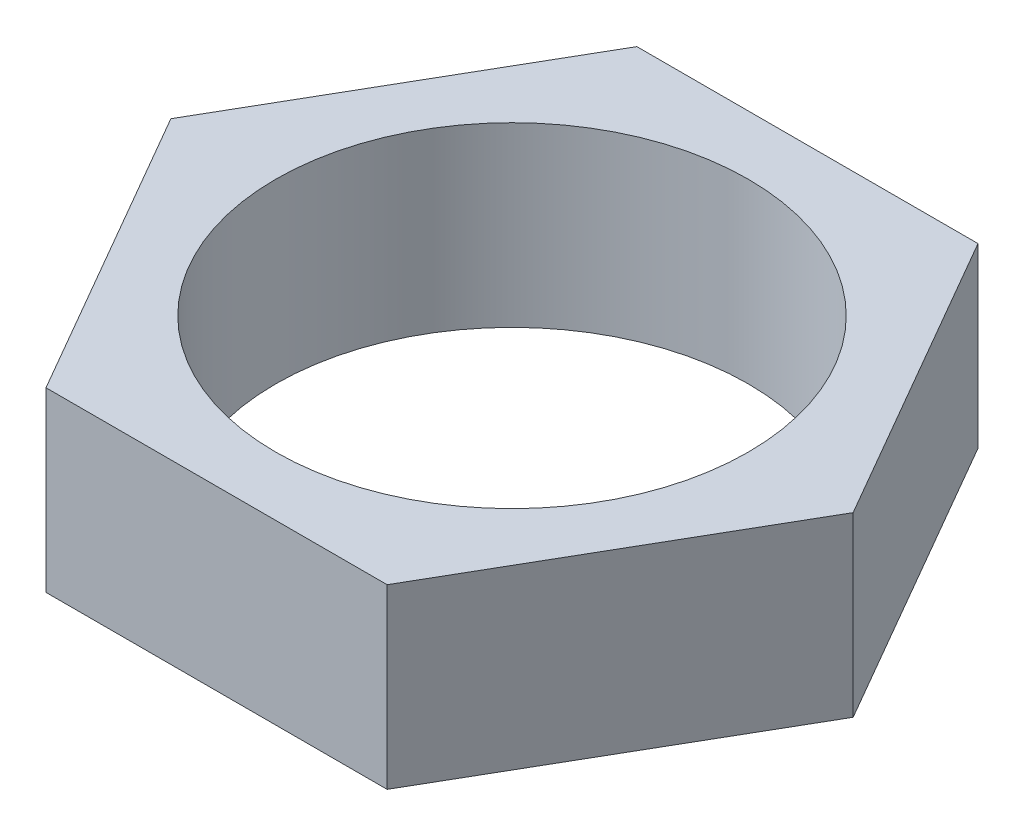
from build123d import *

# Parameters (mm, degrees)
ESQUISSE1_R      = 4
EXTRUSION1_DEPTH = 3


with BuildPart() as part:
    # Esquisse1 → Extrusion1 (new body)
    with BuildSketch(Plane(origin=(0, 0, 0), x_dir=(1, 0, 0), z_dir=(0, 1, 0))):
        Polygon((2.886751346, -5), (5.773502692, 0), (2.886751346, 5), (-2.886751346, 5), (-5.773502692, 0), (-2.886751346, -5), align=None)
        with Locations(Location((0, 0, 0), (0, 0, 270))):
            Circle(ESQUISSE1_R, mode=Mode.SUBTRACT)
    extrude(amount=EXTRUSION1_DEPTH)


solid = part.part
